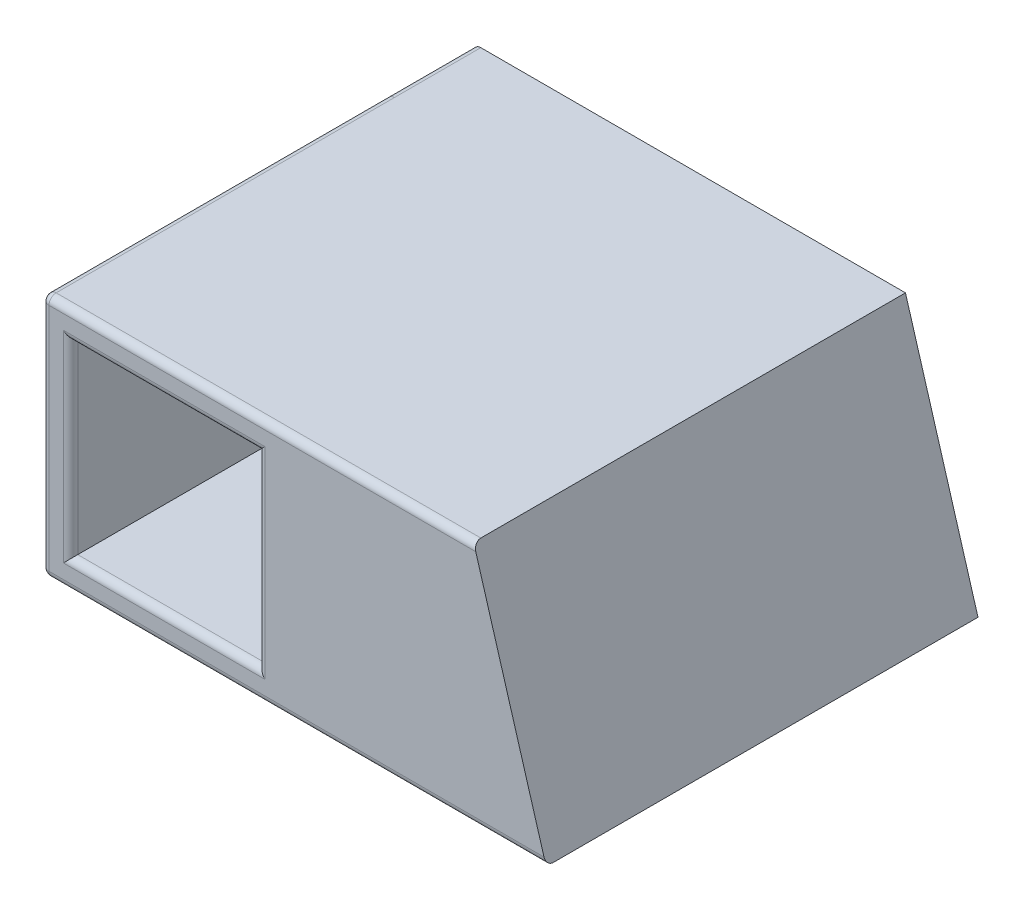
from build123d import *

# Parameters (mm, degrees)
SKETCH4_W                = 3.302
SKETCH4_H                = 3.302
BOSS_EXTRUDE1_DEPTH      = 6.35
FILLET1_R                = 0.127
FILLET2_R                = 0.127
FILLET3_R                = 0.127
BOSS_EXTRUDE2_DEPTH      = 1.27
BOSS_EXTRUDE2_DEPTH_BACK = 0.254
FILLET4_R                = 0.127


with BuildPart() as part:
    # Sketch4 → Boss-Extrude1 (new body)
    with BuildSketch(Plane.XY):
        Polygon((0, 0), (0, 4.318), (7.62, 4.318), (8.899869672, 0), align=None)
        with Locations((2.159, 2.159)):
            Rectangle(SKETCH4_W, SKETCH4_H, mode=Mode.SUBTRACT)
    extrude(amount=BOSS_EXTRUDE1_DEPTH)

    # Fillet1
    fillet1_edges = [part.edges().sort_by_distance(p)[0] for p in [
        (0.508, 2.159, 6.35),
        (2.159, 0.508, 6.35),
        (3.81, 2.159, 6.35),
        (2.159, 3.81, 6.35),
    ]]
    fillet(fillet1_edges, radius=FILLET1_R)

    # Fillet2
    fillet2_edges = [part.edges().sort_by_distance(p)[0] for p in [
        (0.508, 2.159, 0),
        (2.159, 0.508, 0),
        (3.81, 2.159, 0),
        (2.159, 3.81, 0),
    ]]
    fillet(fillet2_edges, radius=FILLET2_R)

    # Fillet3
    fillet3_edges = [part.edges().sort_by_distance(p)[0] for p in [
        (3.81, 4.318, 6.35),
        (0, 2.159, 6.35),
        (4.449934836, 0, 6.35),
        (0, 2.159, 0),
        (3.81, 4.318, 0),
        (4.449934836, 0, 0),
        (0, 0, 3.175),
        (0, 4.318, 3.175),
    ]]
    fillet(fillet3_edges, radius=FILLET3_R)

    # Sketch5 → Boss-Extrude2 (add, two sides: drawn at the far end of the back side and taken through both)
    with BuildSketch(Plane(origin=(0, 0, 0), x_dir=(-1, 0, 0), z_dir=(0, 0, -1)).offset(-BOSS_EXTRUDE2_DEPTH_BACK)):
        Polygon((-8.899869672, 0), (-7.62, 4.318), (0, 4.318), (0, 0), align=None)
    extrude(amount=BOSS_EXTRUDE2_DEPTH + BOSS_EXTRUDE2_DEPTH_BACK)

    # Fillet4
    fillet4_edges = [part.edges().sort_by_distance(p)[0] for p in [
        (0, 0, -0.508),
        (0, 4.318, -0.508),
    ]]
    fillet(fillet4_edges, radius=FILLET4_R)


solid = part.part
